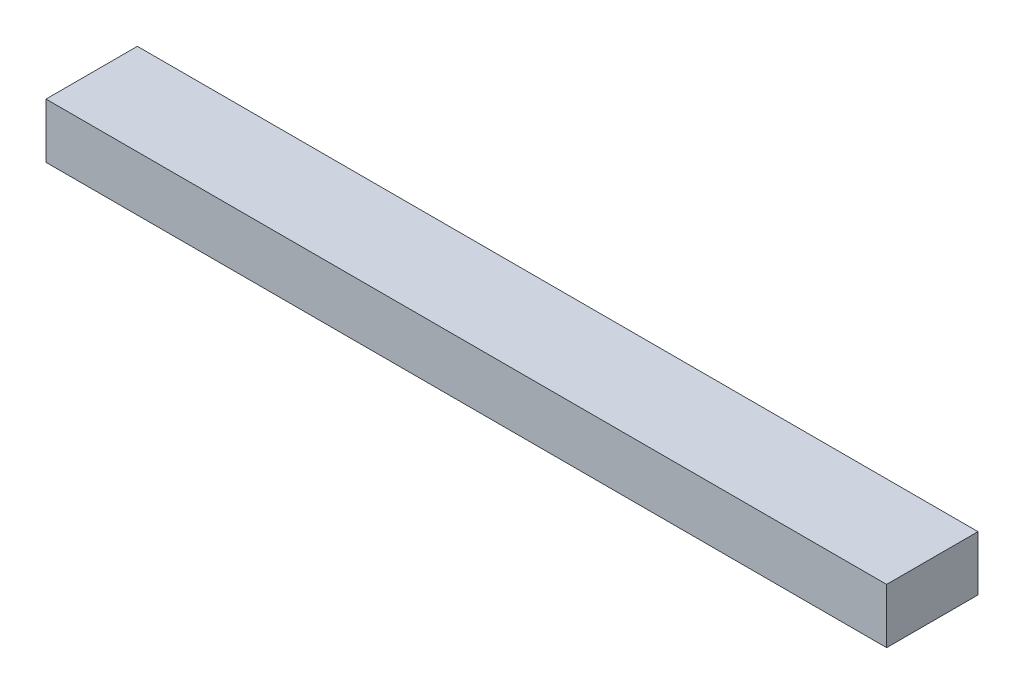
ISO-10303-21;
HEADER;
FILE_DESCRIPTION(('STEP AP214'),'2;1');
FILE_NAME('part.step','',(''),(''),'','','');
FILE_SCHEMA(('AUTOMOTIVE_DESIGN { 1 0 10303 214 1 1 1 1 }'));
ENDSEC;
DATA;
#1=APPLICATION_CONTEXT('core data for automotive mechanical design processes');
#2=APPLICATION_PROTOCOL_DEFINITION('international standard','automotive_design',2000,#1);
#3=PRODUCT_CONTEXT('',#1,'mechanical');
#4=PRODUCT('Part','Part','',(#3));
#5=PRODUCT_RELATED_PRODUCT_CATEGORY('part','',(#4));
#6=PRODUCT_DEFINITION_FORMATION('','',#4);
#7=PRODUCT_DEFINITION_CONTEXT('part definition',#1,'design');
#8=PRODUCT_DEFINITION('design','',#6,#7);
#9=PRODUCT_DEFINITION_SHAPE('','',#8);
#10=(LENGTH_UNIT() NAMED_UNIT(*) SI_UNIT(.MILLI.,.METRE.));
#11=(NAMED_UNIT(*) PLANE_ANGLE_UNIT() SI_UNIT($,.RADIAN.));
#12=(NAMED_UNIT(*) SI_UNIT($,.STERADIAN.) SOLID_ANGLE_UNIT());
#13=UNCERTAINTY_MEASURE_WITH_UNIT(LENGTH_MEASURE(1.E-05),#10,'distance_accuracy_value','');
#14=(GEOMETRIC_REPRESENTATION_CONTEXT(3) GLOBAL_UNCERTAINTY_ASSIGNED_CONTEXT((#13)) GLOBAL_UNIT_ASSIGNED_CONTEXT((#10,
#11,#12)) REPRESENTATION_CONTEXT('',''));
#15=CARTESIAN_POINT('',(0.,0.,0.));
#16=DIRECTION('',(0.,0.,1.));
#17=DIRECTION('',(1.,0.,0.));
#18=AXIS2_PLACEMENT_3D('',#15,#16,#17);
#19=CARTESIAN_POINT('',(-46.,6.,5.));
#20=DIRECTION('',(1.,0.,0.));
#21=DIRECTION('',(0.,0.,-1.));
#22=AXIS2_PLACEMENT_3D('',#19,#20,#21);
#23=PLANE('',#22);
#24=DIRECTION('',(0.,0.,1.));
#25=VECTOR('',#24,1.);
#26=CARTESIAN_POINT('',(-46.,0.,5.));
#27=LINE('',#26,#25);
#28=CARTESIAN_POINT('',(-46.,0.,-5.));
#29=VERTEX_POINT('',#28);
#30=CARTESIAN_POINT('',(-46.,0.,5.));
#31=VERTEX_POINT('',#30);
#32=EDGE_CURVE('E95',#29,#31,#27,.T.);
#33=ORIENTED_EDGE('',*,*,#32,.T.);
#34=DIRECTION('',(0.,-1.,0.));
#35=VECTOR('',#34,1.);
#36=CARTESIAN_POINT('',(-46.,6.,5.));
#37=LINE('',#36,#35);
#38=CARTESIAN_POINT('',(-46.,6.,5.));
#39=VERTEX_POINT('',#38);
#40=EDGE_CURVE('E11',#39,#31,#37,.T.);
#41=ORIENTED_EDGE('',*,*,#40,.F.);
#42=DIRECTION('',(0.,0.,1.));
#43=VECTOR('',#42,1.);
#44=CARTESIAN_POINT('',(-46.,6.,5.));
#45=LINE('',#44,#43);
#46=CARTESIAN_POINT('',(-46.,6.,-5.));
#47=VERTEX_POINT('',#46);
#48=EDGE_CURVE('E83',#47,#39,#45,.T.);
#49=ORIENTED_EDGE('',*,*,#48,.F.);
#50=DIRECTION('',(0.,-1.,0.));
#51=VECTOR('',#50,1.);
#52=CARTESIAN_POINT('',(-46.,6.,-5.));
#53=LINE('',#52,#51);
#54=EDGE_CURVE('E91',#47,#29,#53,.T.);
#55=ORIENTED_EDGE('',*,*,#54,.T.);
#56=EDGE_LOOP('',(#33,#41,#49,#55));
#57=FACE_BOUND('',#56,.T.);
#58=ADVANCED_FACE('F32',(#57),#23,.F.);
#59=CARTESIAN_POINT('',(46.,6.,4.99999999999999));
#60=DIRECTION('',(0.,0.,-1.));
#61=DIRECTION('',(-1.,0.,0.));
#62=AXIS2_PLACEMENT_3D('',#59,#60,#61);
#63=PLANE('',#62);
#64=DIRECTION('',(1.,0.,0.));
#65=VECTOR('',#64,1.);
#66=CARTESIAN_POINT('',(46.,0.,4.99999999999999));
#67=LINE('',#66,#65);
#68=CARTESIAN_POINT('',(46.,0.,4.99999999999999));
#69=VERTEX_POINT('',#68);
#70=EDGE_CURVE('E87',#31,#69,#67,.T.);
#71=ORIENTED_EDGE('',*,*,#70,.T.);
#72=DIRECTION('',(0.,-1.,0.));
#73=VECTOR('',#72,1.);
#74=CARTESIAN_POINT('',(46.,6.,4.99999999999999));
#75=LINE('',#74,#73);
#76=CARTESIAN_POINT('',(46.,6.,4.99999999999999));
#77=VERTEX_POINT('',#76);
#78=EDGE_CURVE('E40',#77,#69,#75,.T.);
#79=ORIENTED_EDGE('',*,*,#78,.F.);
#80=DIRECTION('',(1.,0.,0.));
#81=VECTOR('',#80,1.);
#82=CARTESIAN_POINT('',(46.,6.,4.99999999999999));
#83=LINE('',#82,#81);
#84=EDGE_CURVE('E78',#39,#77,#83,.T.);
#85=ORIENTED_EDGE('',*,*,#84,.F.);
#86=ORIENTED_EDGE('',*,*,#40,.T.);
#87=EDGE_LOOP('',(#71,#79,#85,#86));
#88=FACE_BOUND('',#87,.T.);
#89=ADVANCED_FACE('F86',(#88),#63,.F.);
#90=CARTESIAN_POINT('',(46.,6.,4.99999999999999));
#91=DIRECTION('',(-1.,0.,0.));
#92=DIRECTION('',(0.,0.,1.));
#93=AXIS2_PLACEMENT_3D('',#90,#91,#92);
#94=PLANE('',#93);
#95=DIRECTION('',(0.,0.,-1.));
#96=VECTOR('',#95,1.);
#97=CARTESIAN_POINT('',(46.,0.,4.99999999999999));
#98=LINE('',#97,#96);
#99=CARTESIAN_POINT('',(46.,0.,-5.00000000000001));
#100=VERTEX_POINT('',#99);
#101=EDGE_CURVE('E65',#69,#100,#98,.T.);
#102=ORIENTED_EDGE('',*,*,#101,.T.);
#103=DIRECTION('',(0.,-1.,0.));
#104=VECTOR('',#103,1.);
#105=CARTESIAN_POINT('',(46.,6.,-5.00000000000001));
#106=LINE('',#105,#104);
#107=CARTESIAN_POINT('',(46.,6.,-5.00000000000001));
#108=VERTEX_POINT('',#107);
#109=EDGE_CURVE('E88',#108,#100,#106,.T.);
#110=ORIENTED_EDGE('',*,*,#109,.F.);
#111=DIRECTION('',(0.,0.,-1.));
#112=VECTOR('',#111,1.);
#113=CARTESIAN_POINT('',(46.,6.,4.99999999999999));
#114=LINE('',#113,#112);
#115=EDGE_CURVE('E81',#77,#108,#114,.T.);
#116=ORIENTED_EDGE('',*,*,#115,.F.);
#117=ORIENTED_EDGE('',*,*,#78,.T.);
#118=EDGE_LOOP('',(#102,#110,#116,#117));
#119=FACE_BOUND('',#118,.T.);
#120=ADVANCED_FACE('F89',(#119),#94,.F.);
#121=CARTESIAN_POINT('',(46.,6.,-5.00000000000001));
#122=DIRECTION('',(0.,0.,1.));
#123=DIRECTION('',(1.,0.,0.));
#124=AXIS2_PLACEMENT_3D('',#121,#122,#123);
#125=PLANE('',#124);
#126=DIRECTION('',(-1.,0.,0.));
#127=VECTOR('',#126,1.);
#128=CARTESIAN_POINT('',(46.,0.,-5.00000000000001));
#129=LINE('',#128,#127);
#130=EDGE_CURVE('E71',#100,#29,#129,.T.);
#131=ORIENTED_EDGE('',*,*,#130,.T.);
#132=ORIENTED_EDGE('',*,*,#54,.F.);
#133=DIRECTION('',(-1.,0.,0.));
#134=VECTOR('',#133,1.);
#135=CARTESIAN_POINT('',(46.,6.,-5.00000000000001));
#136=LINE('',#135,#134);
#137=EDGE_CURVE('E48',#108,#47,#136,.T.);
#138=ORIENTED_EDGE('',*,*,#137,.F.);
#139=ORIENTED_EDGE('',*,*,#109,.T.);
#140=EDGE_LOOP('',(#131,#132,#138,#139));
#141=FACE_BOUND('',#140,.T.);
#142=ADVANCED_FACE('F102',(#141),#125,.F.);
#143=CARTESIAN_POINT('',(0.,6.,0.));
#144=DIRECTION('',(0.,1.,0.));
#145=DIRECTION('',(0.,0.,1.));
#146=AXIS2_PLACEMENT_3D('',#143,#144,#145);
#147=PLANE('',#146);
#148=ORIENTED_EDGE('',*,*,#48,.T.);
#149=ORIENTED_EDGE('',*,*,#84,.T.);
#150=ORIENTED_EDGE('',*,*,#115,.T.);
#151=ORIENTED_EDGE('',*,*,#137,.T.);
#152=EDGE_LOOP('',(#148,#149,#150,#151));
#153=FACE_BOUND('',#152,.T.);
#154=ADVANCED_FACE('F79',(#153),#147,.T.);
#155=CARTESIAN_POINT('',(0.,0.,0.));
#156=DIRECTION('',(0.,1.,0.));
#157=DIRECTION('',(0.,0.,1.));
#158=AXIS2_PLACEMENT_3D('',#155,#156,#157);
#159=PLANE('',#158);
#160=ORIENTED_EDGE('',*,*,#32,.F.);
#161=ORIENTED_EDGE('',*,*,#130,.F.);
#162=ORIENTED_EDGE('',*,*,#101,.F.);
#163=ORIENTED_EDGE('',*,*,#70,.F.);
#164=EDGE_LOOP('',(#160,#161,#162,#163));
#165=FACE_BOUND('',#164,.T.);
#166=ADVANCED_FACE('F105',(#165),#159,.F.);
#167=CLOSED_SHELL('',(#58,#89,#120,#142,#154,#166));
#168=MANIFOLD_SOLID_BREP('B2',#167);
#169=ADVANCED_BREP_SHAPE_REPRESENTATION('',(#18,#168),#14);
#170=SHAPE_DEFINITION_REPRESENTATION(#9,#169);
ENDSEC;
END-ISO-10303-21;
